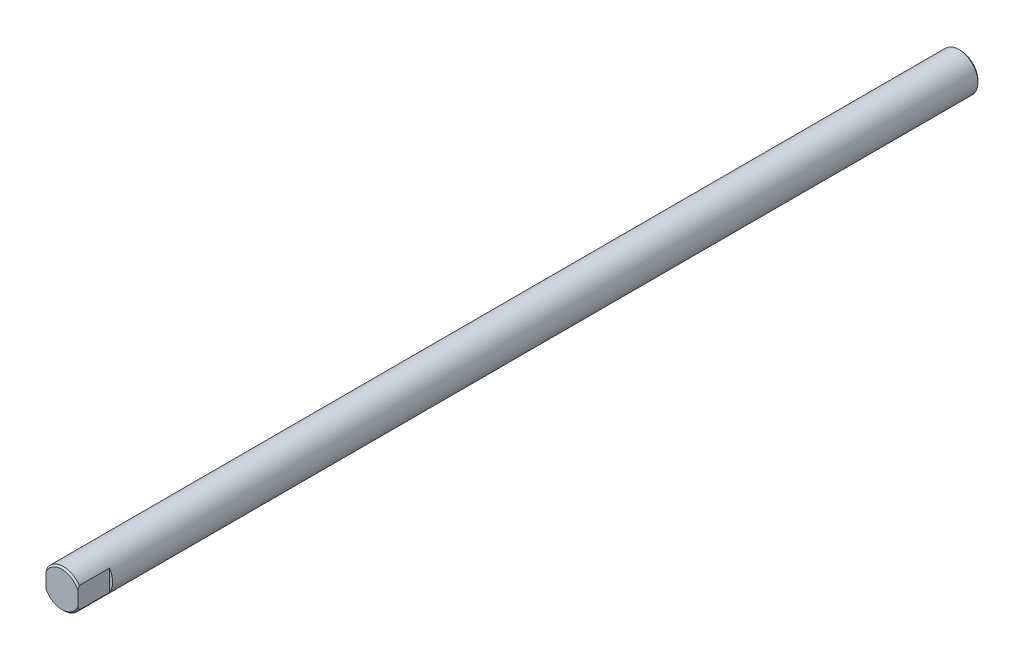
ISO-10303-21;
HEADER;
FILE_DESCRIPTION(('STEP AP214'),'2;1');
FILE_NAME('part.step','',(''),(''),'','','');
FILE_SCHEMA(('AUTOMOTIVE_DESIGN { 1 0 10303 214 1 1 1 1 }'));
ENDSEC;
DATA;
#1=APPLICATION_CONTEXT('core data for automotive mechanical design processes');
#2=APPLICATION_PROTOCOL_DEFINITION('international standard','automotive_design',2000,#1);
#3=PRODUCT_CONTEXT('',#1,'mechanical');
#4=PRODUCT('Part','Part','',(#3));
#5=PRODUCT_RELATED_PRODUCT_CATEGORY('part','',(#4));
#6=PRODUCT_DEFINITION_FORMATION('','',#4);
#7=PRODUCT_DEFINITION_CONTEXT('part definition',#1,'design');
#8=PRODUCT_DEFINITION('design','',#6,#7);
#9=PRODUCT_DEFINITION_SHAPE('','',#8);
#10=(LENGTH_UNIT() NAMED_UNIT(*) SI_UNIT(.MILLI.,.METRE.));
#11=(NAMED_UNIT(*) PLANE_ANGLE_UNIT() SI_UNIT($,.RADIAN.));
#12=(NAMED_UNIT(*) SI_UNIT($,.STERADIAN.) SOLID_ANGLE_UNIT());
#13=UNCERTAINTY_MEASURE_WITH_UNIT(LENGTH_MEASURE(1.E-05),#10,'distance_accuracy_value','');
#14=(GEOMETRIC_REPRESENTATION_CONTEXT(3) GLOBAL_UNCERTAINTY_ASSIGNED_CONTEXT((#13)) GLOBAL_UNIT_ASSIGNED_CONTEXT((#10,
#11,#12)) REPRESENTATION_CONTEXT('',''));
#15=CARTESIAN_POINT('',(0.,0.,0.));
#16=DIRECTION('',(0.,0.,1.));
#17=DIRECTION('',(1.,0.,0.));
#18=AXIS2_PLACEMENT_3D('',#15,#16,#17);
#19=CARTESIAN_POINT('',(0.,0.,283.));
#20=DIRECTION('',(0.,0.,-1.));
#21=DIRECTION('',(-1.,0.,0.));
#22=AXIS2_PLACEMENT_3D('',#19,#20,#21);
#23=CONICAL_SURFACE('',#22,5.5,0.785398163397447);
#24=CARTESIAN_POINT('',(-5.,-9.98473742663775,277.33330928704));
#25=CARTESIAN_POINT('',(-5.,-9.75617019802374,277.537653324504));
#26=CARTESIAN_POINT('',(-5.,-9.5269293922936,277.741250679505));
#27=CARTESIAN_POINT('',(-5.,-9.06674527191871,278.146555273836));
#28=CARTESIAN_POINT('',(-5.,-8.8358017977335,278.348262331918));
#29=CARTESIAN_POINT('',(-5.,-8.3710034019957,278.75012604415));
#30=CARTESIAN_POINT('',(-5.,-8.13714067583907,278.950273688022));
#31=CARTESIAN_POINT('',(-5.,-7.66693566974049,279.3476186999));
#32=CARTESIAN_POINT('',(-5.,-7.43059349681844,279.544816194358));
#33=CARTESIAN_POINT('',(-5.,-6.94074949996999,279.947030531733));
#34=CARTESIAN_POINT('',(-5.,-6.68705990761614,280.151819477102));
#35=CARTESIAN_POINT('',(-5.,-6.17530345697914,280.55583903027));
#36=CARTESIAN_POINT('',(-5.,-5.91723684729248,280.755069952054));
#37=CARTESIAN_POINT('',(-5.,-5.39584205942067,281.145732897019));
#38=CARTESIAN_POINT('',(-5.,-5.13252267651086,281.337176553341));
#39=CARTESIAN_POINT('',(-5.,-4.73207483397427,281.616436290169));
#40=CARTESIAN_POINT('',(-5.,-4.59769670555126,281.708195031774));
#41=CARTESIAN_POINT('',(-5.,-4.32683672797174,281.88854801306));
#42=CARTESIAN_POINT('',(-5.,-4.19035494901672,281.977142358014));
#43=CARTESIAN_POINT('',(-5.,-3.85378538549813,282.189077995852));
#44=CARTESIAN_POINT('',(-5.,-3.65238910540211,282.310361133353));
#45=CARTESIAN_POINT('',(-5.,-3.24350956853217,282.542482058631));
#46=CARTESIAN_POINT('',(-5.,-3.03602421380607,282.653316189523));
#47=CARTESIAN_POINT('',(-5.,-2.61589323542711,282.859988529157));
#48=CARTESIAN_POINT('',(-5.,-2.4033089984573,282.955949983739));
#49=CARTESIAN_POINT('',(-5.,-1.97068013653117,283.129299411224));
#50=CARTESIAN_POINT('',(-5.,-1.7506412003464,283.206701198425));
#51=CARTESIAN_POINT('',(-5.,-1.38099339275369,283.314671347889));
#52=CARTESIAN_POINT('',(-5.,-1.23341252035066,283.352173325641));
#53=CARTESIAN_POINT('',(-5.,-0.935710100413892,283.415276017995));
#54=CARTESIAN_POINT('',(-5.,-0.785588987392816,283.440878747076));
#55=CARTESIAN_POINT('',(-5.,-0.484241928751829,283.478820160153));
#56=CARTESIAN_POINT('',(-5.,-0.333022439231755,283.491209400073));
#57=CARTESIAN_POINT('',(-5.,-0.0300749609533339,283.502200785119));
#58=CARTESIAN_POINT('',(-5.,0.121653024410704,283.500803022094));
#59=CARTESIAN_POINT('',(-5.,0.423681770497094,283.484338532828));
#60=CARTESIAN_POINT('',(-5.,0.573985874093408,283.469332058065));
#61=CARTESIAN_POINT('',(-5.,0.872773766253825,283.426554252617));
#62=CARTESIAN_POINT('',(-5.,1.02125711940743,283.398779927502));
#63=CARTESIAN_POINT('',(-5.,1.31729965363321,283.33141751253));
#64=CARTESIAN_POINT('',(-5.,1.46482808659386,283.291695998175));
#65=CARTESIAN_POINT('',(-5.,1.75673051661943,283.202189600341));
#66=CARTESIAN_POINT('',(-5.,1.90110507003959,283.152406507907));
#67=CARTESIAN_POINT('',(-5.,2.22977372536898,283.028048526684));
#68=CARTESIAN_POINT('',(-5.,2.41294764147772,282.950527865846));
#69=CARTESIAN_POINT('',(-5.,2.7741455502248,282.784218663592));
#70=CARTESIAN_POINT('',(-5.,2.95216673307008,282.695424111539));
#71=CARTESIAN_POINT('',(-5.,3.30416285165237,282.508743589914));
#72=CARTESIAN_POINT('',(-5.,3.47812086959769,282.410825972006));
#73=CARTESIAN_POINT('',(-5.,3.82191392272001,282.208119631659));
#74=CARTESIAN_POINT('',(-5.,3.99174972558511,282.10333220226));
#75=CARTESIAN_POINT('',(-5.,4.31962069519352,281.893635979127));
#76=CARTESIAN_POINT('',(-5.,4.4778242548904,281.788989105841));
#77=CARTESIAN_POINT('',(-5.,4.79153988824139,281.575721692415));
#78=CARTESIAN_POINT('',(-5.,4.94705174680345,281.467100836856));
#79=CARTESIAN_POINT('',(-5.,5.25441241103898,281.247596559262));
#80=CARTESIAN_POINT('',(-5.,5.40628136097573,281.136741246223));
#81=CARTESIAN_POINT('',(-5.,5.70801694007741,280.91241842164));
#82=CARTESIAN_POINT('',(-5.,5.85788409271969,280.798951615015));
#83=CARTESIAN_POINT('',(-5.,6.00692575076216,280.68442855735));
#84=B_SPLINE_CURVE_WITH_KNOTS('',3,(#24,#25,#26,#27,#28,#29,#30,#31,#32,#33,#34,#35,#36,#37,#38,
#39,#40,#41,#42,#43,#44,#45,#46,#47,#48,#49,#50,#51,#52,#53,#54,#55,#56,#57,#58,#59,#60,#61,#62,
#63,#64,#65,#66,#67,#68,#69,#70,#71,#72,#73,#74,#75,#76,#77,#78,#79,#80,#81,#82,#83),
.UNSPECIFIED.,.F.,.F.,(4,2,2,2,2,2,2,2,2,2,2,2,2,2,2,2,2,2,2,2,2,2,2,2,2,2,2,2,2,4),(0.,
0.919784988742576,1.83965728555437,2.76308631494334,3.68647564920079,4.66451159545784,
5.64249217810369,6.61895369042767,7.1070709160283,7.59517188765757,8.30021911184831,
9.00551217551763,9.70460597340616,10.4031777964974,10.8595783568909,11.315901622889,
11.7704726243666,12.2250405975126,12.6776057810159,13.1302771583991,13.5882044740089,
14.0460503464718,14.6422465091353,15.2387618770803,15.8374296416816,16.4359850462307,
17.004960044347,17.5739803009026,18.1380222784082,18.7019137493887),.UNSPECIFIED.);
#85=CARTESIAN_POINT('',(-5.,-3.3166247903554,282.5));
#86=VERTEX_POINT('',#85);
#87=CARTESIAN_POINT('',(-5.,-2.29128784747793,283.));
#88=VERTEX_POINT('',#87);
#89=EDGE_CURVE('E38',#86,#88,#84,.T.);
#90=ORIENTED_EDGE('',*,*,#89,.F.);
#91=CARTESIAN_POINT('',(0.,0.,282.5));
#92=DIRECTION('',(0.,0.,1.));
#93=DIRECTION('',(1.,0.,0.));
#94=AXIS2_PLACEMENT_3D('',#91,#92,#93);
#95=CIRCLE('',#94,6.);
#96=CARTESIAN_POINT('',(5.,-3.3166247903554,282.5));
#97=VERTEX_POINT('',#96);
#98=EDGE_CURVE('E159',#97,#86,#95,.F.);
#99=ORIENTED_EDGE('',*,*,#98,.F.);
#100=CARTESIAN_POINT('',(5.,-10.0169167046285,277.304526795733));
#101=CARTESIAN_POINT('',(5.,-9.78790675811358,277.509398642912));
#102=CARTESIAN_POINT('',(5.,-9.55822576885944,277.713527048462));
#103=CARTESIAN_POINT('',(5.,-9.09716797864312,278.119902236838));
#104=CARTESIAN_POINT('',(5.,-8.86579102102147,278.322148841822));
#105=CARTESIAN_POINT('',(5.,-8.40014483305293,278.725093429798));
#106=CARTESIAN_POINT('',(5.,-8.16586794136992,278.925782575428));
#107=CARTESIAN_POINT('',(5.,-7.69484447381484,279.324225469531));
#108=CARTESIAN_POINT('',(5.,-7.45809800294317,279.521979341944));
#109=CARTESIAN_POINT('',(5.,-6.96746162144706,279.925337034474));
#110=CARTESIAN_POINT('',(5.,-6.71338507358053,280.130714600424));
#111=CARTESIAN_POINT('',(5.,-6.20087312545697,280.535943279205));
#112=CARTESIAN_POINT('',(5.,-5.94243796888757,280.735794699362));
#113=CARTESIAN_POINT('',(5.,-5.42032454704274,281.127746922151));
#114=CARTESIAN_POINT('',(5.,-5.15665491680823,281.319859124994));
#115=CARTESIAN_POINT('',(5.,-4.75570188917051,281.600171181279));
#116=CARTESIAN_POINT('',(5.,-4.62115849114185,281.692289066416));
#117=CARTESIAN_POINT('',(5.,-4.34997516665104,281.873380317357));
#118=CARTESIAN_POINT('',(5.,-4.21333530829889,281.962353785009));
#119=CARTESIAN_POINT('',(5.,-3.87545099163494,282.17583824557));
#120=CARTESIAN_POINT('',(5.,-3.67287839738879,282.298267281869));
#121=CARTESIAN_POINT('',(5.,-3.26159548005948,282.532635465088));
#122=CARTESIAN_POINT('',(5.,-3.05288300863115,282.644570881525));
#123=CARTESIAN_POINT('',(5.,-2.63024038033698,282.853347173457));
#124=CARTESIAN_POINT('',(5.,-2.41637239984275,282.950312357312));
#125=CARTESIAN_POINT('',(5.,-1.98108026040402,283.125513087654));
#126=CARTESIAN_POINT('',(5.,-1.75966198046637,283.203762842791));
#127=CARTESIAN_POINT('',(5.,-1.38848714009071,283.3126712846));
#128=CARTESIAN_POINT('',(5.,-1.240807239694,283.350398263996));
#129=CARTESIAN_POINT('',(5.,-0.942890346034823,283.413951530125));
#130=CARTESIAN_POINT('',(5.,-0.792653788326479,283.439779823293));
#131=CARTESIAN_POINT('',(5.,-0.491064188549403,283.478160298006));
#132=CARTESIAN_POINT('',(5.,-0.339717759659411,283.490763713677));
#133=CARTESIAN_POINT('',(5.,-0.0364974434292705,283.502161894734));
#134=CARTESIAN_POINT('',(5.,0.115376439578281,283.500956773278));
#135=CARTESIAN_POINT('',(5.,0.417724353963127,283.484843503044));
#136=CARTESIAN_POINT('',(5.,0.568201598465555,283.469994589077));
#137=CARTESIAN_POINT('',(5.,0.867343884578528,283.427491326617));
#138=CARTESIAN_POINT('',(5.,1.01600849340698,283.399833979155));
#139=CARTESIAN_POINT('',(5.,1.31242424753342,283.332664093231));
#140=CARTESIAN_POINT('',(5.,1.46014452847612,283.293017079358));
#141=CARTESIAN_POINT('',(5.,1.7524265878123,283.203620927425));
#142=CARTESIAN_POINT('',(5.,1.89698891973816,283.153873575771));
#143=CARTESIAN_POINT('',(5.,2.22542170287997,283.029809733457));
#144=CARTESIAN_POINT('',(5.,2.40818880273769,282.952587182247));
#145=CARTESIAN_POINT('',(5.,2.76859425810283,282.786902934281));
#146=CARTESIAN_POINT('',(5.,2.94622982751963,282.698435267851));
#147=CARTESIAN_POINT('',(5.,3.29746783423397,282.512427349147));
#148=CARTESIAN_POINT('',(5.,3.47105344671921,282.414855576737));
#149=CARTESIAN_POINT('',(5.,3.8141132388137,282.212850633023));
#150=CARTESIAN_POINT('',(5.,3.98358818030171,282.108418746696));
#151=CARTESIAN_POINT('',(5.,4.31077192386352,281.899415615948));
#152=CARTESIAN_POINT('',(5.,4.46864856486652,281.795105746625));
#153=CARTESIAN_POINT('',(5.,4.7817148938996,281.582514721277));
#154=CARTESIAN_POINT('',(5.,4.93690436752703,281.474233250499));
#155=CARTESIAN_POINT('',(5.,5.24362827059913,281.255404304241));
#156=CARTESIAN_POINT('',(5.,5.39518278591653,281.144884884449));
#157=CARTESIAN_POINT('',(5.,5.69629156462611,280.921234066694));
#158=CARTESIAN_POINT('',(5.,5.84584635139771,280.80810337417));
#159=CARTESIAN_POINT('',(5.,5.99457618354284,280.693916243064));
#160=B_SPLINE_CURVE_WITH_KNOTS('',3,(#100,#101,#102,#103,#104,#105,#106,#107,#108,#109,#110,
#111,#112,#113,#114,#115,#116,#117,#118,#119,#120,#121,#122,#123,#124,#125,#126,#127,#128,#129,
#130,#131,#132,#133,#134,#135,#136,#137,#138,#139,#140,#141,#142,#143,#144,#145,#146,#147,#148,
#149,#150,#151,#152,#153,#154,#155,#156,#157,#158,#159),.UNSPECIFIED.,.F.,.F.,(4,2,2,2,2,2,2,2,
2,2,2,2,2,2,2,2,2,2,2,2,2,2,2,2,2,2,2,2,2,4),(0.,0.921830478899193,1.84374720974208,
2.7691768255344,3.69456725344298,4.67461661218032,5.65461135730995,6.63310539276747,
7.12224047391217,7.61135969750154,8.32120384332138,9.03129938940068,9.73513826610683,
10.4384410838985,10.8952968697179,11.3520755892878,11.8070781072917,12.2620768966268,
12.7151095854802,13.1682484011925,13.6266709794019,14.0850125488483,14.6797386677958,
15.2747818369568,15.8719675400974,16.4690417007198,17.0366409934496,17.6042853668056,
18.1669713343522,18.729507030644),.UNSPECIFIED.);
#161=CARTESIAN_POINT('',(5.,-2.29128784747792,283.));
#162=VERTEX_POINT('',#161);
#163=EDGE_CURVE('E99',#162,#97,#160,.F.);
#164=ORIENTED_EDGE('',*,*,#163,.F.);
#165=CARTESIAN_POINT('',(0.,0.,283.));
#166=DIRECTION('',(0.,0.,1.));
#167=DIRECTION('',(1.,0.,0.));
#168=AXIS2_PLACEMENT_3D('',#165,#166,#167);
#169=CIRCLE('',#168,5.5);
#170=EDGE_CURVE('E52',#88,#162,#169,.T.);
#171=ORIENTED_EDGE('',*,*,#170,.F.);
#172=EDGE_LOOP('',(#90,#99,#164,#171));
#173=FACE_BOUND('',#172,.T.);
#174=ADVANCED_FACE('F30',(#173),#23,.T.);
#175=CARTESIAN_POINT('',(0.,0.,283.));
#176=DIRECTION('',(0.,0.,-1.));
#177=DIRECTION('',(-1.,0.,0.));
#178=AXIS2_PLACEMENT_3D('',#175,#176,#177);
#179=CYLINDRICAL_SURFACE('',#178,6.);
#180=ORIENTED_EDGE('',*,*,#98,.T.);
#181=DIRECTION('',(0.,0.,-1.));
#182=VECTOR('',#181,1.);
#183=CARTESIAN_POINT('',(-5.,-3.3166247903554,283.));
#184=LINE('',#183,#182);
#185=CARTESIAN_POINT('',(-5.,-3.3166247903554,273.));
#186=VERTEX_POINT('',#185);
#187=EDGE_CURVE('E87',#86,#186,#184,.T.);
#188=ORIENTED_EDGE('',*,*,#187,.T.);
#189=CARTESIAN_POINT('',(0.,0.,273.));
#190=DIRECTION('',(0.,0.,1.));
#191=DIRECTION('',(1.,0.,0.));
#192=AXIS2_PLACEMENT_3D('',#189,#190,#191);
#193=CIRCLE('',#192,6.);
#194=CARTESIAN_POINT('',(-5.,3.3166247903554,273.));
#195=VERTEX_POINT('',#194);
#196=EDGE_CURVE('E11',#195,#186,#193,.T.);
#197=ORIENTED_EDGE('',*,*,#196,.F.);
#198=DIRECTION('',(0.,0.,-1.));
#199=VECTOR('',#198,1.);
#200=CARTESIAN_POINT('',(-5.,3.3166247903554,283.));
#201=LINE('',#200,#199);
#202=CARTESIAN_POINT('',(-5.,3.3166247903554,282.5));
#203=VERTEX_POINT('',#202);
#204=EDGE_CURVE('E182',#195,#203,#201,.F.);
#205=ORIENTED_EDGE('',*,*,#204,.T.);
#206=CARTESIAN_POINT('',(5.,3.3166247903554,282.5));
#207=VERTEX_POINT('',#206);
#208=EDGE_CURVE('E163',#203,#207,#95,.F.);
#209=ORIENTED_EDGE('',*,*,#208,.T.);
#210=DIRECTION('',(0.,0.,-1.));
#211=VECTOR('',#210,1.);
#212=CARTESIAN_POINT('',(5.,3.3166247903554,283.));
#213=LINE('',#212,#211);
#214=CARTESIAN_POINT('',(5.,3.3166247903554,273.));
#215=VERTEX_POINT('',#214);
#216=EDGE_CURVE('E172',#207,#215,#213,.T.);
#217=ORIENTED_EDGE('',*,*,#216,.T.);
#218=CARTESIAN_POINT('',(0.,0.,273.));
#219=DIRECTION('',(0.,0.,-1.));
#220=DIRECTION('',(-1.,0.,0.));
#221=AXIS2_PLACEMENT_3D('',#218,#219,#220);
#222=CIRCLE('',#221,6.);
#223=CARTESIAN_POINT('',(5.,-3.3166247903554,273.));
#224=VERTEX_POINT('',#223);
#225=EDGE_CURVE('E114',#215,#224,#222,.T.);
#226=ORIENTED_EDGE('',*,*,#225,.T.);
#227=DIRECTION('',(0.,0.,-1.));
#228=VECTOR('',#227,1.);
#229=CARTESIAN_POINT('',(5.,-3.3166247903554,283.));
#230=LINE('',#229,#228);
#231=EDGE_CURVE('E175',#224,#97,#230,.F.);
#232=ORIENTED_EDGE('',*,*,#231,.T.);
#233=EDGE_LOOP('',(#180,#188,#197,#205,#209,#217,#226,#232));
#234=FACE_BOUND('',#233,.T.);
#235=CARTESIAN_POINT('',(0.,0.,0.5));
#236=DIRECTION('',(0.,0.,1.));
#237=DIRECTION('',(1.,0.,0.));
#238=AXIS2_PLACEMENT_3D('',#235,#236,#237);
#239=CIRCLE('',#238,6.);
#240=CARTESIAN_POINT('',(6.,0.,0.5));
#241=VERTEX_POINT('',#240);
#242=EDGE_CURVE('E103',#241,#241,#239,.T.);
#243=ORIENTED_EDGE('',*,*,#242,.T.);
#244=EDGE_LOOP('',(#243));
#245=FACE_BOUND('',#244,.T.);
#246=ADVANCED_FACE('F32',(#234,#245),#179,.T.);
#247=CARTESIAN_POINT('',(0.,0.,283.));
#248=DIRECTION('',(0.,0.,1.));
#249=DIRECTION('',(1.,0.,0.));
#250=AXIS2_PLACEMENT_3D('',#247,#248,#249);
#251=PLANE('',#250);
#252=DIRECTION('',(0.,1.,0.));
#253=VECTOR('',#252,1.);
#254=CARTESIAN_POINT('',(-5.,5.89864060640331,283.));
#255=LINE('',#254,#253);
#256=CARTESIAN_POINT('',(-5.,2.29128784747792,283.));
#257=VERTEX_POINT('',#256);
#258=EDGE_CURVE('E45',#88,#257,#255,.T.);
#259=ORIENTED_EDGE('',*,*,#258,.F.);
#260=ORIENTED_EDGE('',*,*,#170,.T.);
#261=DIRECTION('',(0.,-1.,0.));
#262=VECTOR('',#261,1.);
#263=CARTESIAN_POINT('',(5.,5.62300319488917,283.));
#264=LINE('',#263,#262);
#265=CARTESIAN_POINT('',(5.,2.29128784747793,283.));
#266=VERTEX_POINT('',#265);
#267=EDGE_CURVE('E179',#266,#162,#264,.T.);
#268=ORIENTED_EDGE('',*,*,#267,.F.);
#269=EDGE_CURVE('E95',#266,#257,#169,.T.);
#270=ORIENTED_EDGE('',*,*,#269,.T.);
#271=EDGE_LOOP('',(#259,#260,#268,#270));
#272=FACE_BOUND('',#271,.T.);
#273=ADVANCED_FACE('F93',(#272),#251,.T.);
#274=CARTESIAN_POINT('',(0.,0.,0.));
#275=DIRECTION('',(0.,0.,1.));
#276=DIRECTION('',(1.,0.,0.));
#277=AXIS2_PLACEMENT_3D('',#274,#275,#276);
#278=PLANE('',#277);
#279=CARTESIAN_POINT('',(0.,0.,0.));
#280=DIRECTION('',(0.,0.,-1.));
#281=DIRECTION('',(-1.,0.,0.));
#282=AXIS2_PLACEMENT_3D('',#279,#280,#281);
#283=CIRCLE('',#282,2.39999999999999);
#284=CARTESIAN_POINT('',(-2.39999999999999,0.,0.));
#285=VERTEX_POINT('',#284);
#286=EDGE_CURVE('E166',#285,#285,#283,.T.);
#287=ORIENTED_EDGE('',*,*,#286,.F.);
#288=EDGE_LOOP('',(#287));
#289=FACE_BOUND('',#288,.T.);
#290=CARTESIAN_POINT('',(0.,0.,0.));
#291=DIRECTION('',(0.,0.,1.));
#292=DIRECTION('',(1.,0.,0.));
#293=AXIS2_PLACEMENT_3D('',#290,#291,#292);
#294=CIRCLE('',#293,5.49999999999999);
#295=CARTESIAN_POINT('',(5.49999999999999,0.,0.));
#296=VERTEX_POINT('',#295);
#297=EDGE_CURVE('E100',#296,#296,#294,.F.);
#298=ORIENTED_EDGE('',*,*,#297,.T.);
#299=EDGE_LOOP('',(#298));
#300=FACE_BOUND('',#299,.T.);
#301=ADVANCED_FACE('F156',(#289,#300),#278,.F.);
#302=CARTESIAN_POINT('',(0.,0.,0.5));
#303=DIRECTION('',(0.,0.,1.));
#304=DIRECTION('',(1.,0.,0.));
#305=AXIS2_PLACEMENT_3D('',#302,#303,#304);
#306=CONICAL_SURFACE('',#305,6.,0.785398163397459);
#307=ORIENTED_EDGE('',*,*,#297,.F.);
#308=EDGE_LOOP('',(#307));
#309=FACE_BOUND('',#308,.T.);
#310=ORIENTED_EDGE('',*,*,#242,.F.);
#311=EDGE_LOOP('',(#310));
#312=FACE_BOUND('',#311,.T.);
#313=ADVANCED_FACE('F125',(#309,#312),#306,.T.);
#314=EDGE_CURVE('E91',#257,#203,#84,.T.);
#315=ORIENTED_EDGE('',*,*,#314,.F.);
#316=ORIENTED_EDGE('',*,*,#269,.F.);
#317=EDGE_CURVE('E113',#207,#266,#160,.F.);
#318=ORIENTED_EDGE('',*,*,#317,.F.);
#319=ORIENTED_EDGE('',*,*,#208,.F.);
#320=EDGE_LOOP('',(#315,#316,#318,#319));
#321=FACE_BOUND('',#320,.T.);
#322=ADVANCED_FACE('F119',(#321),#23,.T.);
#323=CARTESIAN_POINT('',(0.,0.,0.));
#324=DIRECTION('',(0.,0.,-1.));
#325=DIRECTION('',(-1.,0.,0.));
#326=AXIS2_PLACEMENT_3D('',#323,#324,#325);
#327=CYLINDRICAL_SURFACE('',#326,2.39999999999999);
#328=CARTESIAN_POINT('',(0.,0.,32.));
#329=DIRECTION('',(0.,0.,-1.));
#330=DIRECTION('',(-1.,0.,0.));
#331=AXIS2_PLACEMENT_3D('',#328,#329,#330);
#332=CIRCLE('',#331,2.39999999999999);
#333=CARTESIAN_POINT('',(-2.39999999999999,0.,32.));
#334=VERTEX_POINT('',#333);
#335=EDGE_CURVE('E169',#334,#334,#332,.T.);
#336=ORIENTED_EDGE('',*,*,#335,.F.);
#337=EDGE_LOOP('',(#336));
#338=FACE_BOUND('',#337,.T.);
#339=ORIENTED_EDGE('',*,*,#286,.T.);
#340=EDGE_LOOP('',(#339));
#341=FACE_BOUND('',#340,.T.);
#342=ADVANCED_FACE('F124',(#338,#341),#327,.F.);
#343=CARTESIAN_POINT('',(0.,0.,32.));
#344=DIRECTION('',(0.,0.,-1.));
#345=DIRECTION('',(-1.,0.,0.));
#346=AXIS2_PLACEMENT_3D('',#343,#344,#345);
#347=CONICAL_SURFACE('',#346,2.39999999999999,1.02974425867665);
#348=CARTESIAN_POINT('',(0.,0.,33.4420654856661));
#349=VERTEX_POINT('',#348);
#350=VERTEX_LOOP('',#349);
#351=FACE_BOUND('',#350,.T.);
#352=ORIENTED_EDGE('',*,*,#335,.T.);
#353=EDGE_LOOP('',(#352));
#354=FACE_BOUND('',#353,.T.);
#355=ADVANCED_FACE('F139',(#351,#354),#347,.F.);
#356=CARTESIAN_POINT('',(9.4285744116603,5.62300319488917,273.));
#357=DIRECTION('',(0.,0.,-1.));
#358=DIRECTION('',(-1.,0.,0.));
#359=AXIS2_PLACEMENT_3D('',#356,#357,#358);
#360=PLANE('',#359);
#361=DIRECTION('',(0.,-1.,0.));
#362=VECTOR('',#361,1.);
#363=CARTESIAN_POINT('',(5.,5.62300319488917,273.));
#364=LINE('',#363,#362);
#365=EDGE_CURVE('E177',#215,#224,#364,.T.);
#366=ORIENTED_EDGE('',*,*,#365,.T.);
#367=ORIENTED_EDGE('',*,*,#225,.F.);
#368=EDGE_LOOP('',(#366,#367));
#369=FACE_BOUND('',#368,.T.);
#370=ADVANCED_FACE('F137',(#369),#360,.F.);
#371=CARTESIAN_POINT('',(5.,5.62300319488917,273.));
#372=DIRECTION('',(-1.,0.,0.));
#373=DIRECTION('',(0.,-1.,0.));
#374=AXIS2_PLACEMENT_3D('',#371,#372,#373);
#375=PLANE('',#374);
#376=ORIENTED_EDGE('',*,*,#317,.T.);
#377=ORIENTED_EDGE('',*,*,#267,.T.);
#378=ORIENTED_EDGE('',*,*,#163,.T.);
#379=ORIENTED_EDGE('',*,*,#231,.F.);
#380=ORIENTED_EDGE('',*,*,#365,.F.);
#381=ORIENTED_EDGE('',*,*,#216,.F.);
#382=EDGE_LOOP('',(#376,#377,#378,#379,#380,#381));
#383=FACE_BOUND('',#382,.T.);
#384=ADVANCED_FACE('F115',(#383),#375,.F.);
#385=CARTESIAN_POINT('',(-8.54653469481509,5.89864060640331,273.));
#386=DIRECTION('',(0.,0.,1.));
#387=DIRECTION('',(1.,0.,0.));
#388=AXIS2_PLACEMENT_3D('',#385,#386,#387);
#389=PLANE('',#388);
#390=ORIENTED_EDGE('',*,*,#196,.T.);
#391=DIRECTION('',(0.,1.,0.));
#392=VECTOR('',#391,1.);
#393=CARTESIAN_POINT('',(-5.,5.89864060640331,273.));
#394=LINE('',#393,#392);
#395=EDGE_CURVE('E96',#186,#195,#394,.T.);
#396=ORIENTED_EDGE('',*,*,#395,.T.);
#397=EDGE_LOOP('',(#390,#396));
#398=FACE_BOUND('',#397,.T.);
#399=ADVANCED_FACE('F136',(#398),#389,.T.);
#400=CARTESIAN_POINT('',(-5.,5.89864060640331,273.));
#401=DIRECTION('',(1.,0.,0.));
#402=DIRECTION('',(0.,1.,0.));
#403=AXIS2_PLACEMENT_3D('',#400,#401,#402);
#404=PLANE('',#403);
#405=ORIENTED_EDGE('',*,*,#89,.T.);
#406=ORIENTED_EDGE('',*,*,#258,.T.);
#407=ORIENTED_EDGE('',*,*,#314,.T.);
#408=ORIENTED_EDGE('',*,*,#204,.F.);
#409=ORIENTED_EDGE('',*,*,#395,.F.);
#410=ORIENTED_EDGE('',*,*,#187,.F.);
#411=EDGE_LOOP('',(#405,#406,#407,#408,#409,#410));
#412=FACE_BOUND('',#411,.T.);
#413=ADVANCED_FACE('F84',(#412),#404,.F.);
#414=CLOSED_SHELL('',(#174,#246,#273,#301,#313,#322,#342,#355,#370,#384,#399,#413));
#415=MANIFOLD_SOLID_BREP('B2',#414);
#416=ADVANCED_BREP_SHAPE_REPRESENTATION('',(#18,#415),#14);
#417=SHAPE_DEFINITION_REPRESENTATION(#9,#416);
ENDSEC;
END-ISO-10303-21;
